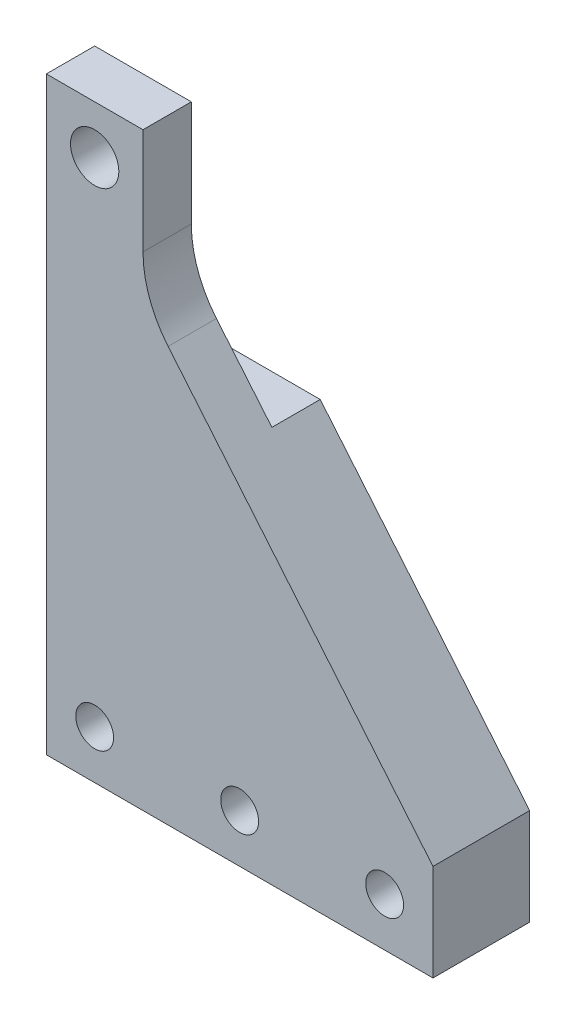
from build123d import *

# Parameters (mm, degrees)
SKETCH1_W           = 50.8
SKETCH1_H           = 77.47
SKETCH1_R           = 2.4892
SKETCH1_R_2         = 3.175
BOSS_EXTRUDE1_DEPTH = 12.7
CUT_EXTRUDE1_DEPTH  = 85.824211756
CUT_EXTRUDE2_START  = -12.7
CUT_EXTRUDE2_DEPTH  = 6.35
FILLET1_R           = 14.224


with BuildPart() as part:
    # Sketch1 → Boss-Extrude1 (new body)
    with BuildSketch(Plane.XY):
        with Locations((19.05, 32.385)):
            Rectangle(SKETCH1_W, SKETCH1_H)
        Circle(SKETCH1_R, mode=Mode.SUBTRACT)
        with Locations((38.1, 0)):
            Circle(SKETCH1_R, mode=Mode.SUBTRACT)
        with Locations((19.05, 0)):
            Circle(SKETCH1_R, mode=Mode.SUBTRACT)
        with Locations((0, 64.77)):
            Circle(SKETCH1_R_2, mode=Mode.SUBTRACT)
    extrude(amount=BOSS_EXTRUDE1_DEPTH)

    # Sketch2 → Cut-Extrude1 (cut, through all)
    with BuildSketch(Plane.XY.offset(12.7)):
        Polygon((44.45, 6.35), (6.35, 52.07), (6.35, 71.12), (44.45, 71.12), align=None)
    extrude(amount=-CUT_EXTRUDE1_DEPTH, mode=Mode.SUBTRACT)

    # Sketch3 → Cut-Extrude2 (cut)
    with BuildSketch(Plane.XY.offset(12.7).offset(CUT_EXTRUDE2_START)):
        Polygon((-6.35, 39.37), (16.933333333, 39.37), (6.35, 52.07), (6.35, 71.12), (-6.35, 71.12), align=None)
    extrude(amount=CUT_EXTRUDE2_DEPTH, mode=Mode.SUBTRACT)

    # Fillet1
    fillet1_edges = [part.edges().sort_by_distance(p)[0] for p in [
        (6.35, 52.07, 9.525),
    ]]
    fillet(fillet1_edges, radius=FILLET1_R)


solid = part.part
